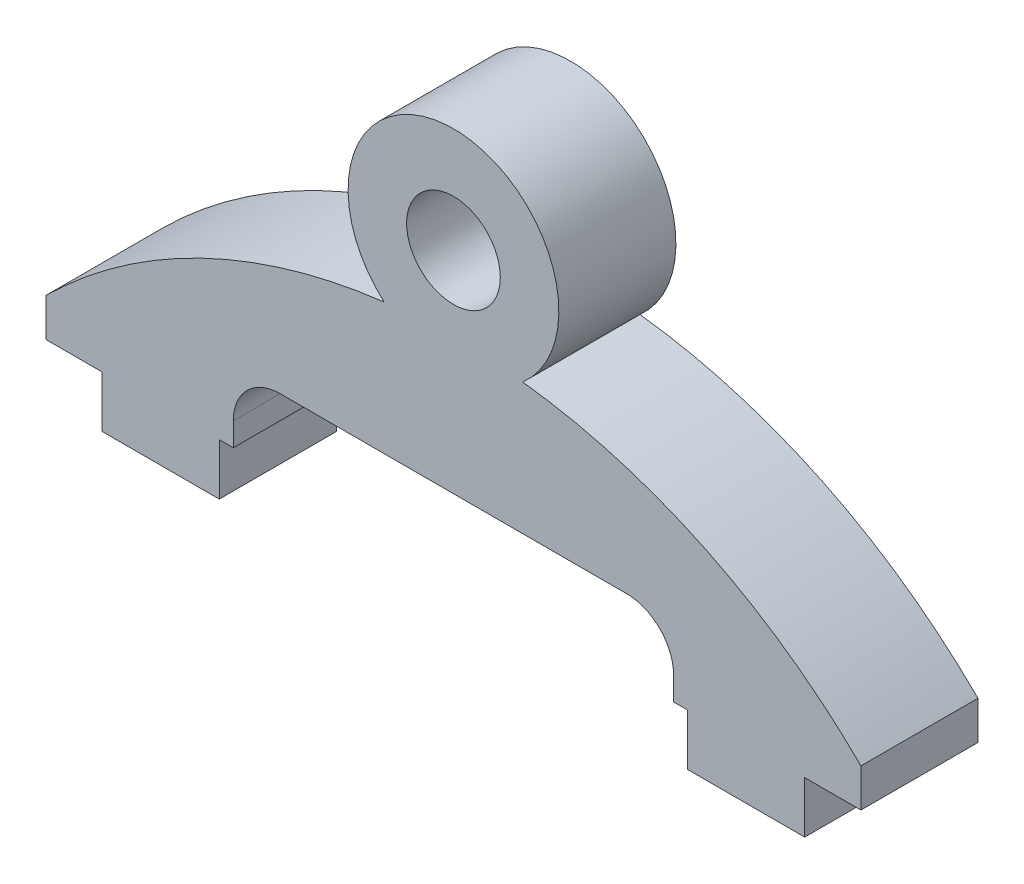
ISO-10303-21;
HEADER;
FILE_DESCRIPTION(('STEP AP214'),'2;1');
FILE_NAME('part.step','',(''),(''),'','','');
FILE_SCHEMA(('AUTOMOTIVE_DESIGN { 1 0 10303 214 1 1 1 1 }'));
ENDSEC;
DATA;
#1=APPLICATION_CONTEXT('core data for automotive mechanical design processes');
#2=APPLICATION_PROTOCOL_DEFINITION('international standard','automotive_design',2000,#1);
#3=PRODUCT_CONTEXT('',#1,'mechanical');
#4=PRODUCT('Part','Part','',(#3));
#5=PRODUCT_RELATED_PRODUCT_CATEGORY('part','',(#4));
#6=PRODUCT_DEFINITION_FORMATION('','',#4);
#7=PRODUCT_DEFINITION_CONTEXT('part definition',#1,'design');
#8=PRODUCT_DEFINITION('design','',#6,#7);
#9=PRODUCT_DEFINITION_SHAPE('','',#8);
#10=(LENGTH_UNIT() NAMED_UNIT(*) SI_UNIT(.MILLI.,.METRE.));
#11=(NAMED_UNIT(*) PLANE_ANGLE_UNIT() SI_UNIT($,.RADIAN.));
#12=(NAMED_UNIT(*) SI_UNIT($,.STERADIAN.) SOLID_ANGLE_UNIT());
#13=UNCERTAINTY_MEASURE_WITH_UNIT(LENGTH_MEASURE(1.E-05),#10,'distance_accuracy_value','');
#14=(GEOMETRIC_REPRESENTATION_CONTEXT(3) GLOBAL_UNCERTAINTY_ASSIGNED_CONTEXT((#13)) GLOBAL_UNIT_ASSIGNED_CONTEXT((#10,
#11,#12)) REPRESENTATION_CONTEXT('',''));
#15=CARTESIAN_POINT('',(0.,0.,0.));
#16=DIRECTION('',(0.,0.,1.));
#17=DIRECTION('',(1.,0.,0.));
#18=AXIS2_PLACEMENT_3D('',#15,#16,#17);
#19=CARTESIAN_POINT('',(9.398,1.27,6.35));
#20=DIRECTION('',(0.,0.,-1.));
#21=DIRECTION('',(-1.,0.,0.));
#22=AXIS2_PLACEMENT_3D('',#19,#20,#21);
#23=CYLINDRICAL_SURFACE('',#22,2.54);
#24=CARTESIAN_POINT('',(9.398,1.27,0.));
#25=DIRECTION('',(0.,0.,1.));
#26=DIRECTION('',(1.,0.,0.));
#27=AXIS2_PLACEMENT_3D('',#24,#25,#26);
#28=CIRCLE('',#27,2.54);
#29=CARTESIAN_POINT('',(11.938,1.26999999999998,0.));
#30=VERTEX_POINT('',#29);
#31=CARTESIAN_POINT('',(9.39799999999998,3.81,0.));
#32=VERTEX_POINT('',#31);
#33=EDGE_CURVE('E205',#30,#32,#28,.T.);
#34=ORIENTED_EDGE('',*,*,#33,.F.);
#35=DIRECTION('',(0.,0.,-1.));
#36=VECTOR('',#35,1.);
#37=CARTESIAN_POINT('',(11.938,1.26999999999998,6.35));
#38=LINE('',#37,#36);
#39=CARTESIAN_POINT('',(11.938,1.26999999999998,6.35));
#40=VERTEX_POINT('',#39);
#41=EDGE_CURVE('E11',#40,#30,#38,.T.);
#42=ORIENTED_EDGE('',*,*,#41,.F.);
#43=CARTESIAN_POINT('',(9.398,1.27,6.35));
#44=DIRECTION('',(0.,0.,1.));
#45=DIRECTION('',(1.,0.,0.));
#46=AXIS2_PLACEMENT_3D('',#43,#44,#45);
#47=CIRCLE('',#46,2.54);
#48=CARTESIAN_POINT('',(9.39799999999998,3.81,6.35));
#49=VERTEX_POINT('',#48);
#50=EDGE_CURVE('E256',#40,#49,#47,.T.);
#51=ORIENTED_EDGE('',*,*,#50,.T.);
#52=DIRECTION('',(0.,0.,-1.));
#53=VECTOR('',#52,1.);
#54=CARTESIAN_POINT('',(9.39799999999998,3.81,6.35));
#55=LINE('',#54,#53);
#56=EDGE_CURVE('E51',#49,#32,#55,.T.);
#57=ORIENTED_EDGE('',*,*,#56,.T.);
#58=EDGE_LOOP('',(#34,#42,#51,#57));
#59=FACE_BOUND('',#58,.T.);
#60=ADVANCED_FACE('F35',(#59),#23,.F.);
#61=CARTESIAN_POINT('',(11.938,0.,6.35));
#62=DIRECTION('',(-1.,0.,0.));
#63=DIRECTION('',(0.,0.,1.));
#64=AXIS2_PLACEMENT_3D('',#61,#62,#63);
#65=PLANE('',#64);
#66=DIRECTION('',(0.,1.,0.));
#67=VECTOR('',#66,1.);
#68=CARTESIAN_POINT('',(11.938,0.,0.));
#69=LINE('',#68,#67);
#70=CARTESIAN_POINT('',(11.938,0.,0.));
#71=VERTEX_POINT('',#70);
#72=EDGE_CURVE('E207',#71,#30,#69,.T.);
#73=ORIENTED_EDGE('',*,*,#72,.F.);
#74=DIRECTION('',(0.,0.,-1.));
#75=VECTOR('',#74,1.);
#76=CARTESIAN_POINT('',(11.938,0.,6.35));
#77=LINE('',#76,#75);
#78=CARTESIAN_POINT('',(11.938,0.,6.35));
#79=VERTEX_POINT('',#78);
#80=EDGE_CURVE('E43',#79,#71,#77,.T.);
#81=ORIENTED_EDGE('',*,*,#80,.F.);
#82=DIRECTION('',(0.,1.,0.));
#83=VECTOR('',#82,1.);
#84=CARTESIAN_POINT('',(11.938,0.,6.35));
#85=LINE('',#84,#83);
#86=EDGE_CURVE('E589',#79,#40,#85,.T.);
#87=ORIENTED_EDGE('',*,*,#86,.T.);
#88=ORIENTED_EDGE('',*,*,#41,.T.);
#89=EDGE_LOOP('',(#73,#81,#87,#88));
#90=FACE_BOUND('',#89,.T.);
#91=ADVANCED_FACE('F301',(#90),#65,.T.);
#92=CARTESIAN_POINT('',(0.,0.,6.35));
#93=DIRECTION('',(0.,-1.,0.));
#94=DIRECTION('',(0.,0.,-1.));
#95=AXIS2_PLACEMENT_3D('',#92,#93,#94);
#96=PLANE('',#95);
#97=DIRECTION('',(-1.,0.,0.));
#98=VECTOR('',#97,1.);
#99=CARTESIAN_POINT('',(0.,0.,0.));
#100=LINE('',#99,#98);
#101=CARTESIAN_POINT('',(12.7,0.,0.));
#102=VERTEX_POINT('',#101);
#103=EDGE_CURVE('E210',#102,#71,#100,.T.);
#104=ORIENTED_EDGE('',*,*,#103,.F.);
#105=DIRECTION('',(0.,0.,-1.));
#106=VECTOR('',#105,1.);
#107=CARTESIAN_POINT('',(12.7,0.,6.35));
#108=LINE('',#107,#106);
#109=CARTESIAN_POINT('',(12.7,0.,6.35));
#110=VERTEX_POINT('',#109);
#111=EDGE_CURVE('E290',#110,#102,#108,.T.);
#112=ORIENTED_EDGE('',*,*,#111,.F.);
#113=DIRECTION('',(-1.,0.,0.));
#114=VECTOR('',#113,1.);
#115=CARTESIAN_POINT('',(0.,0.,6.35));
#116=LINE('',#115,#114);
#117=EDGE_CURVE('E297',#110,#79,#116,.T.);
#118=ORIENTED_EDGE('',*,*,#117,.T.);
#119=ORIENTED_EDGE('',*,*,#80,.T.);
#120=EDGE_LOOP('',(#104,#112,#118,#119));
#121=FACE_BOUND('',#120,.T.);
#122=ADVANCED_FACE('F295',(#121),#96,.T.);
#123=CARTESIAN_POINT('',(12.7,0.,6.35));
#124=DIRECTION('',(1.,0.,0.));
#125=DIRECTION('',(0.,0.,-1.));
#126=AXIS2_PLACEMENT_3D('',#123,#124,#125);
#127=PLANE('',#126);
#128=DIRECTION('',(0.,-1.,0.));
#129=VECTOR('',#128,1.);
#130=CARTESIAN_POINT('',(12.7,0.,0.));
#131=LINE('',#130,#129);
#132=CARTESIAN_POINT('',(12.7,-2.794,0.));
#133=VERTEX_POINT('',#132);
#134=EDGE_CURVE('E213',#102,#133,#131,.T.);
#135=ORIENTED_EDGE('',*,*,#134,.T.);
#136=DIRECTION('',(0.,0.,-1.));
#137=VECTOR('',#136,1.);
#138=CARTESIAN_POINT('',(12.7,-2.794,6.35));
#139=LINE('',#138,#137);
#140=CARTESIAN_POINT('',(12.7,-2.794,6.35));
#141=VERTEX_POINT('',#140);
#142=EDGE_CURVE('E287',#141,#133,#139,.T.);
#143=ORIENTED_EDGE('',*,*,#142,.F.);
#144=DIRECTION('',(0.,-1.,0.));
#145=VECTOR('',#144,1.);
#146=CARTESIAN_POINT('',(12.7,0.,6.35));
#147=LINE('',#146,#145);
#148=EDGE_CURVE('E319',#110,#141,#147,.T.);
#149=ORIENTED_EDGE('',*,*,#148,.F.);
#150=ORIENTED_EDGE('',*,*,#111,.T.);
#151=EDGE_LOOP('',(#135,#143,#149,#150));
#152=FACE_BOUND('',#151,.T.);
#153=ADVANCED_FACE('F309',(#152),#127,.F.);
#154=CARTESIAN_POINT('',(0.,-2.794,6.35));
#155=DIRECTION('',(0.,1.,0.));
#156=DIRECTION('',(-1.,0.,0.));
#157=AXIS2_PLACEMENT_3D('',#154,#155,#156);
#158=PLANE('',#157);
#159=DIRECTION('',(1.,0.,0.));
#160=VECTOR('',#159,1.);
#161=CARTESIAN_POINT('',(0.,-2.794,0.));
#162=LINE('',#161,#160);
#163=CARTESIAN_POINT('',(19.05,-2.794,0.));
#164=VERTEX_POINT('',#163);
#165=EDGE_CURVE('E216',#133,#164,#162,.T.);
#166=ORIENTED_EDGE('',*,*,#165,.T.);
#167=DIRECTION('',(0.,0.,-1.));
#168=VECTOR('',#167,1.);
#169=CARTESIAN_POINT('',(19.05,-2.794,6.35));
#170=LINE('',#169,#168);
#171=CARTESIAN_POINT('',(19.05,-2.794,6.35));
#172=VERTEX_POINT('',#171);
#173=EDGE_CURVE('E285',#172,#164,#170,.T.);
#174=ORIENTED_EDGE('',*,*,#173,.F.);
#175=DIRECTION('',(1.,0.,0.));
#176=VECTOR('',#175,1.);
#177=CARTESIAN_POINT('',(0.,-2.794,6.35));
#178=LINE('',#177,#176);
#179=EDGE_CURVE('E315',#141,#172,#178,.T.);
#180=ORIENTED_EDGE('',*,*,#179,.F.);
#181=ORIENTED_EDGE('',*,*,#142,.T.);
#182=EDGE_LOOP('',(#166,#174,#180,#181));
#183=FACE_BOUND('',#182,.T.);
#184=ADVANCED_FACE('F313',(#183),#158,.F.);
#185=CARTESIAN_POINT('',(19.05,0.,6.35));
#186=DIRECTION('',(1.,0.,0.));
#187=DIRECTION('',(0.,0.,-1.));
#188=AXIS2_PLACEMENT_3D('',#185,#186,#187);
#189=PLANE('',#188);
#190=DIRECTION('',(0.,-1.,0.));
#191=VECTOR('',#190,1.);
#192=CARTESIAN_POINT('',(19.05,0.,0.));
#193=LINE('',#192,#191);
#194=CARTESIAN_POINT('',(19.05,0.,0.));
#195=VERTEX_POINT('',#194);
#196=EDGE_CURVE('E219',#195,#164,#193,.T.);
#197=ORIENTED_EDGE('',*,*,#196,.F.);
#198=DIRECTION('',(0.,0.,-1.));
#199=VECTOR('',#198,1.);
#200=CARTESIAN_POINT('',(19.05,0.,6.35));
#201=LINE('',#200,#199);
#202=CARTESIAN_POINT('',(19.05,0.,6.35));
#203=VERTEX_POINT('',#202);
#204=EDGE_CURVE('E283',#203,#195,#201,.T.);
#205=ORIENTED_EDGE('',*,*,#204,.F.);
#206=DIRECTION('',(0.,-1.,0.));
#207=VECTOR('',#206,1.);
#208=CARTESIAN_POINT('',(19.05,0.,6.35));
#209=LINE('',#208,#207);
#210=EDGE_CURVE('E318',#203,#172,#209,.T.);
#211=ORIENTED_EDGE('',*,*,#210,.T.);
#212=ORIENTED_EDGE('',*,*,#173,.T.);
#213=EDGE_LOOP('',(#197,#205,#211,#212));
#214=FACE_BOUND('',#213,.T.);
#215=ADVANCED_FACE('F533',(#214),#189,.T.);
#216=CARTESIAN_POINT('',(22.098,0.,0.));
#217=VERTEX_POINT('',#216);
#218=EDGE_CURVE('E214',#217,#195,#100,.T.);
#219=ORIENTED_EDGE('',*,*,#218,.F.);
#220=DIRECTION('',(0.,0.,-1.));
#221=VECTOR('',#220,1.);
#222=CARTESIAN_POINT('',(22.098,0.,6.35));
#223=LINE('',#222,#221);
#224=CARTESIAN_POINT('',(22.098,0.,6.35));
#225=VERTEX_POINT('',#224);
#226=EDGE_CURVE('E281',#225,#217,#223,.T.);
#227=ORIENTED_EDGE('',*,*,#226,.F.);
#228=EDGE_CURVE('E321',#225,#203,#116,.T.);
#229=ORIENTED_EDGE('',*,*,#228,.T.);
#230=ORIENTED_EDGE('',*,*,#204,.T.);
#231=EDGE_LOOP('',(#219,#227,#229,#230));
#232=FACE_BOUND('',#231,.T.);
#233=ADVANCED_FACE('F523',(#232),#96,.T.);
#234=CARTESIAN_POINT('',(22.098,0.,6.35));
#235=DIRECTION('',(-1.,0.,0.));
#236=DIRECTION('',(0.,0.,1.));
#237=AXIS2_PLACEMENT_3D('',#234,#235,#236);
#238=PLANE('',#237);
#239=DIRECTION('',(0.,1.,0.));
#240=VECTOR('',#239,1.);
#241=CARTESIAN_POINT('',(22.098,0.,0.));
#242=LINE('',#241,#240);
#243=CARTESIAN_POINT('',(22.098,2.07663375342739,0.));
#244=VERTEX_POINT('',#243);
#245=EDGE_CURVE('E222',#217,#244,#242,.T.);
#246=ORIENTED_EDGE('',*,*,#245,.T.);
#247=DIRECTION('',(0.,0.,-1.));
#248=VECTOR('',#247,1.);
#249=CARTESIAN_POINT('',(22.098,2.07663375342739,6.35));
#250=LINE('',#249,#248);
#251=CARTESIAN_POINT('',(22.098,2.07663375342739,6.35));
#252=VERTEX_POINT('',#251);
#253=EDGE_CURVE('E278',#252,#244,#250,.T.);
#254=ORIENTED_EDGE('',*,*,#253,.F.);
#255=DIRECTION('',(0.,1.,0.));
#256=VECTOR('',#255,1.);
#257=CARTESIAN_POINT('',(22.098,0.,6.35));
#258=LINE('',#257,#256);
#259=EDGE_CURVE('E326',#225,#252,#258,.T.);
#260=ORIENTED_EDGE('',*,*,#259,.F.);
#261=ORIENTED_EDGE('',*,*,#226,.T.);
#262=EDGE_LOOP('',(#246,#254,#260,#261));
#263=FACE_BOUND('',#262,.T.);
#264=ADVANCED_FACE('F513',(#263),#238,.F.);
#265=CARTESIAN_POINT('',(0.067141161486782,-20.122779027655,6.35));
#266=DIRECTION('',(0.,0.,-1.));
#267=DIRECTION('',(-1.,0.,0.));
#268=AXIS2_PLACEMENT_3D('',#265,#266,#267);
#269=CYLINDRICAL_SURFACE('',#268,31.2757520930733);
#270=CARTESIAN_POINT('',(0.067141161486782,-20.122779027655,0.));
#271=DIRECTION('',(0.,0.,1.));
#272=DIRECTION('',(1.,0.,0.));
#273=AXIS2_PLACEMENT_3D('',#270,#271,#272);
#274=CIRCLE('',#273,31.2757520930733);
#275=CARTESIAN_POINT('',(3.75808520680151,10.9344198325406,0.));
#276=VERTEX_POINT('',#275);
#277=EDGE_CURVE('E224',#244,#276,#274,.T.);
#278=ORIENTED_EDGE('',*,*,#277,.T.);
#279=DIRECTION('',(0.,0.,-1.));
#280=VECTOR('',#279,1.);
#281=CARTESIAN_POINT('',(3.75808520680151,10.9344198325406,6.35));
#282=LINE('',#281,#280);
#283=CARTESIAN_POINT('',(3.75808520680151,10.9344198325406,6.35));
#284=VERTEX_POINT('',#283);
#285=EDGE_CURVE('E275',#284,#276,#282,.T.);
#286=ORIENTED_EDGE('',*,*,#285,.F.);
#287=CARTESIAN_POINT('',(0.067141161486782,-20.122779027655,6.35));
#288=DIRECTION('',(0.,0.,1.));
#289=DIRECTION('',(1.,0.,0.));
#290=AXIS2_PLACEMENT_3D('',#287,#288,#289);
#291=CIRCLE('',#290,31.2757520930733);
#292=EDGE_CURVE('E328',#252,#284,#291,.T.);
#293=ORIENTED_EDGE('',*,*,#292,.F.);
#294=ORIENTED_EDGE('',*,*,#253,.T.);
#295=EDGE_LOOP('',(#278,#286,#293,#294));
#296=FACE_BOUND('',#295,.T.);
#297=ADVANCED_FACE('F503',(#296),#269,.T.);
#298=CARTESIAN_POINT('',(0.,15.24,6.35));
#299=DIRECTION('',(0.,0.,-1.));
#300=DIRECTION('',(-1.,0.,0.));
#301=AXIS2_PLACEMENT_3D('',#298,#299,#300);
#302=CYLINDRICAL_SURFACE('',#301,5.715);
#303=CARTESIAN_POINT('',(0.,15.24,0.));
#304=DIRECTION('',(0.,0.,1.));
#305=DIRECTION('',(1.,0.,0.));
#306=AXIS2_PLACEMENT_3D('',#303,#304,#305);
#307=CIRCLE('',#306,5.715);
#308=CARTESIAN_POINT('',(-3.75808520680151,10.9344198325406,0.));
#309=VERTEX_POINT('',#308);
#310=EDGE_CURVE('E226',#276,#309,#307,.T.);
#311=ORIENTED_EDGE('',*,*,#310,.T.);
#312=DIRECTION('',(0.,0.,-1.));
#313=VECTOR('',#312,1.);
#314=CARTESIAN_POINT('',(-3.75808520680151,10.9344198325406,6.35));
#315=LINE('',#314,#313);
#316=CARTESIAN_POINT('',(-3.75808520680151,10.9344198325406,6.35));
#317=VERTEX_POINT('',#316);
#318=EDGE_CURVE('E273',#317,#309,#315,.T.);
#319=ORIENTED_EDGE('',*,*,#318,.F.);
#320=CARTESIAN_POINT('',(0.,15.24,6.35));
#321=DIRECTION('',(0.,0.,1.));
#322=DIRECTION('',(1.,0.,0.));
#323=AXIS2_PLACEMENT_3D('',#320,#321,#322);
#324=CIRCLE('',#323,5.715);
#325=EDGE_CURVE('E330',#284,#317,#324,.T.);
#326=ORIENTED_EDGE('',*,*,#325,.F.);
#327=ORIENTED_EDGE('',*,*,#285,.T.);
#328=EDGE_LOOP('',(#311,#319,#326,#327));
#329=FACE_BOUND('',#328,.T.);
#330=ADVANCED_FACE('F493',(#329),#302,.T.);
#331=CARTESIAN_POINT('',(-0.067141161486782,-20.122779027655,6.35));
#332=DIRECTION('',(0.,0.,-1.));
#333=DIRECTION('',(-1.,0.,0.));
#334=AXIS2_PLACEMENT_3D('',#331,#332,#333);
#335=CYLINDRICAL_SURFACE('',#334,31.2757520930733);
#336=CARTESIAN_POINT('',(-0.067141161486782,-20.122779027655,0.));
#337=DIRECTION('',(0.,0.,1.));
#338=DIRECTION('',(1.,0.,0.));
#339=AXIS2_PLACEMENT_3D('',#336,#337,#338);
#340=CIRCLE('',#339,31.2757520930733);
#341=CARTESIAN_POINT('',(-22.098,2.07663375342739,0.));
#342=VERTEX_POINT('',#341);
#343=EDGE_CURVE('E229',#342,#309,#340,.F.);
#344=ORIENTED_EDGE('',*,*,#343,.F.);
#345=DIRECTION('',(0.,0.,-1.));
#346=VECTOR('',#345,1.);
#347=CARTESIAN_POINT('',(-22.098,2.07663375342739,6.35));
#348=LINE('',#347,#346);
#349=CARTESIAN_POINT('',(-22.098,2.07663375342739,6.35));
#350=VERTEX_POINT('',#349);
#351=EDGE_CURVE('E271',#350,#342,#348,.T.);
#352=ORIENTED_EDGE('',*,*,#351,.F.);
#353=CARTESIAN_POINT('',(-0.067141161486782,-20.122779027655,6.35));
#354=DIRECTION('',(0.,0.,1.));
#355=DIRECTION('',(1.,0.,0.));
#356=AXIS2_PLACEMENT_3D('',#353,#354,#355);
#357=CIRCLE('',#356,31.2757520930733);
#358=EDGE_CURVE('E332',#350,#317,#357,.F.);
#359=ORIENTED_EDGE('',*,*,#358,.T.);
#360=ORIENTED_EDGE('',*,*,#318,.T.);
#361=EDGE_LOOP('',(#344,#352,#359,#360));
#362=FACE_BOUND('',#361,.T.);
#363=ADVANCED_FACE('F483',(#362),#335,.T.);
#364=CARTESIAN_POINT('',(-22.098,0.,6.35));
#365=DIRECTION('',(-1.,0.,0.));
#366=DIRECTION('',(0.,0.,1.));
#367=AXIS2_PLACEMENT_3D('',#364,#365,#366);
#368=PLANE('',#367);
#369=DIRECTION('',(0.,1.,0.));
#370=VECTOR('',#369,1.);
#371=CARTESIAN_POINT('',(-22.098,0.,0.));
#372=LINE('',#371,#370);
#373=CARTESIAN_POINT('',(-22.098,0.,0.));
#374=VERTEX_POINT('',#373);
#375=EDGE_CURVE('E232',#374,#342,#372,.T.);
#376=ORIENTED_EDGE('',*,*,#375,.F.);
#377=DIRECTION('',(0.,0.,-1.));
#378=VECTOR('',#377,1.);
#379=CARTESIAN_POINT('',(-22.098,0.,6.35));
#380=LINE('',#379,#378);
#381=CARTESIAN_POINT('',(-22.098,0.,6.35));
#382=VERTEX_POINT('',#381);
#383=EDGE_CURVE('E269',#382,#374,#380,.T.);
#384=ORIENTED_EDGE('',*,*,#383,.F.);
#385=DIRECTION('',(0.,1.,0.));
#386=VECTOR('',#385,1.);
#387=CARTESIAN_POINT('',(-22.098,0.,6.35));
#388=LINE('',#387,#386);
#389=EDGE_CURVE('E335',#382,#350,#388,.T.);
#390=ORIENTED_EDGE('',*,*,#389,.T.);
#391=ORIENTED_EDGE('',*,*,#351,.T.);
#392=EDGE_LOOP('',(#376,#384,#390,#391));
#393=FACE_BOUND('',#392,.T.);
#394=ADVANCED_FACE('F370',(#393),#368,.T.);
#395=CARTESIAN_POINT('',(0.,0.,6.35));
#396=DIRECTION('',(0.,1.,0.));
#397=DIRECTION('',(0.,0.,1.));
#398=AXIS2_PLACEMENT_3D('',#395,#396,#397);
#399=PLANE('',#398);
#400=DIRECTION('',(1.,0.,0.));
#401=VECTOR('',#400,1.);
#402=CARTESIAN_POINT('',(0.,0.,0.));
#403=LINE('',#402,#401);
#404=CARTESIAN_POINT('',(-19.05,0.,0.));
#405=VERTEX_POINT('',#404);
#406=EDGE_CURVE('E235',#374,#405,#403,.T.);
#407=ORIENTED_EDGE('',*,*,#406,.T.);
#408=DIRECTION('',(0.,0.,-1.));
#409=VECTOR('',#408,1.);
#410=CARTESIAN_POINT('',(-19.05,0.,6.35));
#411=LINE('',#410,#409);
#412=CARTESIAN_POINT('',(-19.05,0.,6.35));
#413=VERTEX_POINT('',#412);
#414=EDGE_CURVE('E266',#413,#405,#411,.T.);
#415=ORIENTED_EDGE('',*,*,#414,.F.);
#416=DIRECTION('',(1.,0.,0.));
#417=VECTOR('',#416,1.);
#418=CARTESIAN_POINT('',(0.,0.,6.35));
#419=LINE('',#418,#417);
#420=EDGE_CURVE('E338',#382,#413,#419,.T.);
#421=ORIENTED_EDGE('',*,*,#420,.F.);
#422=ORIENTED_EDGE('',*,*,#383,.T.);
#423=EDGE_LOOP('',(#407,#415,#421,#422));
#424=FACE_BOUND('',#423,.T.);
#425=ADVANCED_FACE('F361',(#424),#399,.F.);
#426=CARTESIAN_POINT('',(-19.05,0.,6.35));
#427=DIRECTION('',(1.,0.,0.));
#428=DIRECTION('',(0.,0.,-1.));
#429=AXIS2_PLACEMENT_3D('',#426,#427,#428);
#430=PLANE('',#429);
#431=DIRECTION('',(0.,-1.,0.));
#432=VECTOR('',#431,1.);
#433=CARTESIAN_POINT('',(-19.05,0.,0.));
#434=LINE('',#433,#432);
#435=CARTESIAN_POINT('',(-19.05,-2.794,0.));
#436=VERTEX_POINT('',#435);
#437=EDGE_CURVE('E237',#405,#436,#434,.T.);
#438=ORIENTED_EDGE('',*,*,#437,.T.);
#439=DIRECTION('',(0.,0.,-1.));
#440=VECTOR('',#439,1.);
#441=CARTESIAN_POINT('',(-19.05,-2.794,6.35));
#442=LINE('',#441,#440);
#443=CARTESIAN_POINT('',(-19.05,-2.794,6.35));
#444=VERTEX_POINT('',#443);
#445=EDGE_CURVE('E264',#444,#436,#442,.T.);
#446=ORIENTED_EDGE('',*,*,#445,.F.);
#447=DIRECTION('',(0.,-1.,0.));
#448=VECTOR('',#447,1.);
#449=CARTESIAN_POINT('',(-19.05,0.,6.35));
#450=LINE('',#449,#448);
#451=EDGE_CURVE('E340',#413,#444,#450,.T.);
#452=ORIENTED_EDGE('',*,*,#451,.F.);
#453=ORIENTED_EDGE('',*,*,#414,.T.);
#454=EDGE_LOOP('',(#438,#446,#452,#453));
#455=FACE_BOUND('',#454,.T.);
#456=ADVANCED_FACE('F369',(#455),#430,.F.);
#457=CARTESIAN_POINT('',(0.,-2.794,6.35));
#458=DIRECTION('',(0.,-1.,0.));
#459=DIRECTION('',(1.,0.,0.));
#460=AXIS2_PLACEMENT_3D('',#457,#458,#459);
#461=PLANE('',#460);
#462=DIRECTION('',(-1.,0.,0.));
#463=VECTOR('',#462,1.);
#464=CARTESIAN_POINT('',(0.,-2.794,0.));
#465=LINE('',#464,#463);
#466=CARTESIAN_POINT('',(-12.7,-2.794,0.));
#467=VERTEX_POINT('',#466);
#468=EDGE_CURVE('E241',#467,#436,#465,.T.);
#469=ORIENTED_EDGE('',*,*,#468,.F.);
#470=DIRECTION('',(0.,0.,-1.));
#471=VECTOR('',#470,1.);
#472=CARTESIAN_POINT('',(-12.7,-2.794,6.35));
#473=LINE('',#472,#471);
#474=CARTESIAN_POINT('',(-12.7,-2.794,6.35));
#475=VERTEX_POINT('',#474);
#476=EDGE_CURVE('E262',#475,#467,#473,.T.);
#477=ORIENTED_EDGE('',*,*,#476,.F.);
#478=DIRECTION('',(-1.,0.,0.));
#479=VECTOR('',#478,1.);
#480=CARTESIAN_POINT('',(0.,-2.794,6.35));
#481=LINE('',#480,#479);
#482=EDGE_CURVE('E342',#475,#444,#481,.T.);
#483=ORIENTED_EDGE('',*,*,#482,.T.);
#484=ORIENTED_EDGE('',*,*,#445,.T.);
#485=EDGE_LOOP('',(#469,#477,#483,#484));
#486=FACE_BOUND('',#485,.T.);
#487=ADVANCED_FACE('F354',(#486),#461,.T.);
#488=CARTESIAN_POINT('',(-12.7,0.,6.35));
#489=DIRECTION('',(1.,0.,0.));
#490=DIRECTION('',(0.,0.,-1.));
#491=AXIS2_PLACEMENT_3D('',#488,#489,#490);
#492=PLANE('',#491);
#493=DIRECTION('',(0.,-1.,0.));
#494=VECTOR('',#493,1.);
#495=CARTESIAN_POINT('',(-12.7,0.,0.));
#496=LINE('',#495,#494);
#497=CARTESIAN_POINT('',(-12.7,0.,0.));
#498=VERTEX_POINT('',#497);
#499=EDGE_CURVE('E244',#498,#467,#496,.T.);
#500=ORIENTED_EDGE('',*,*,#499,.F.);
#501=DIRECTION('',(0.,0.,-1.));
#502=VECTOR('',#501,1.);
#503=CARTESIAN_POINT('',(-12.7,0.,6.35));
#504=LINE('',#503,#502);
#505=CARTESIAN_POINT('',(-12.7,0.,6.35));
#506=VERTEX_POINT('',#505);
#507=EDGE_CURVE('E260',#506,#498,#504,.T.);
#508=ORIENTED_EDGE('',*,*,#507,.F.);
#509=DIRECTION('',(0.,-1.,0.));
#510=VECTOR('',#509,1.);
#511=CARTESIAN_POINT('',(-12.7,0.,6.35));
#512=LINE('',#511,#510);
#513=EDGE_CURVE('E344',#506,#475,#512,.T.);
#514=ORIENTED_EDGE('',*,*,#513,.T.);
#515=ORIENTED_EDGE('',*,*,#476,.T.);
#516=EDGE_LOOP('',(#500,#508,#514,#515));
#517=FACE_BOUND('',#516,.T.);
#518=ADVANCED_FACE('F348',(#517),#492,.T.);
#519=CARTESIAN_POINT('',(-11.938,0.,0.));
#520=VERTEX_POINT('',#519);
#521=EDGE_CURVE('E238',#498,#520,#403,.T.);
#522=ORIENTED_EDGE('',*,*,#521,.T.);
#523=DIRECTION('',(0.,0.,-1.));
#524=VECTOR('',#523,1.);
#525=CARTESIAN_POINT('',(-11.938,0.,6.35));
#526=LINE('',#525,#524);
#527=CARTESIAN_POINT('',(-11.938,0.,6.35));
#528=VERTEX_POINT('',#527);
#529=EDGE_CURVE('E194',#528,#520,#526,.T.);
#530=ORIENTED_EDGE('',*,*,#529,.F.);
#531=EDGE_CURVE('E182',#506,#528,#419,.T.);
#532=ORIENTED_EDGE('',*,*,#531,.F.);
#533=ORIENTED_EDGE('',*,*,#507,.T.);
#534=EDGE_LOOP('',(#522,#530,#532,#533));
#535=FACE_BOUND('',#534,.T.);
#536=ADVANCED_FACE('F358',(#535),#399,.F.);
#537=CARTESIAN_POINT('',(-11.938,0.,6.35));
#538=DIRECTION('',(-1.,0.,0.));
#539=DIRECTION('',(0.,0.,1.));
#540=AXIS2_PLACEMENT_3D('',#537,#538,#539);
#541=PLANE('',#540);
#542=DIRECTION('',(0.,1.,0.));
#543=VECTOR('',#542,1.);
#544=CARTESIAN_POINT('',(-11.938,0.,0.));
#545=LINE('',#544,#543);
#546=CARTESIAN_POINT('',(-11.938,1.26999999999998,0.));
#547=VERTEX_POINT('',#546);
#548=EDGE_CURVE('E191',#520,#547,#545,.T.);
#549=ORIENTED_EDGE('',*,*,#548,.T.);
#550=DIRECTION('',(0.,0.,-1.));
#551=VECTOR('',#550,1.);
#552=CARTESIAN_POINT('',(-11.938,1.26999999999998,6.35));
#553=LINE('',#552,#551);
#554=CARTESIAN_POINT('',(-11.938,1.26999999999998,6.35));
#555=VERTEX_POINT('',#554);
#556=EDGE_CURVE('E188',#555,#547,#553,.T.);
#557=ORIENTED_EDGE('',*,*,#556,.F.);
#558=DIRECTION('',(0.,1.,0.));
#559=VECTOR('',#558,1.);
#560=CARTESIAN_POINT('',(-11.938,0.,6.35));
#561=LINE('',#560,#559);
#562=EDGE_CURVE('E173',#528,#555,#561,.T.);
#563=ORIENTED_EDGE('',*,*,#562,.F.);
#564=ORIENTED_EDGE('',*,*,#529,.T.);
#565=EDGE_LOOP('',(#549,#557,#563,#564));
#566=FACE_BOUND('',#565,.T.);
#567=ADVANCED_FACE('F189',(#566),#541,.F.);
#568=CARTESIAN_POINT('',(-9.398,1.27,6.35));
#569=DIRECTION('',(0.,0.,-1.));
#570=DIRECTION('',(-1.,0.,0.));
#571=AXIS2_PLACEMENT_3D('',#568,#569,#570);
#572=CYLINDRICAL_SURFACE('',#571,2.54);
#573=CARTESIAN_POINT('',(-9.398,1.27,0.));
#574=DIRECTION('',(0.,0.,1.));
#575=DIRECTION('',(1.,0.,0.));
#576=AXIS2_PLACEMENT_3D('',#573,#574,#575);
#577=CIRCLE('',#576,2.54);
#578=CARTESIAN_POINT('',(-9.39799999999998,3.81,0.));
#579=VERTEX_POINT('',#578);
#580=EDGE_CURVE('E248',#547,#579,#577,.F.);
#581=ORIENTED_EDGE('',*,*,#580,.T.);
#582=DIRECTION('',(0.,0.,-1.));
#583=VECTOR('',#582,1.);
#584=CARTESIAN_POINT('',(-9.39799999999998,3.81,6.35));
#585=LINE('',#584,#583);
#586=CARTESIAN_POINT('',(-9.39799999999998,3.81,6.35));
#587=VERTEX_POINT('',#586);
#588=EDGE_CURVE('E113',#587,#579,#585,.T.);
#589=ORIENTED_EDGE('',*,*,#588,.F.);
#590=CARTESIAN_POINT('',(-9.398,1.27,6.35));
#591=DIRECTION('',(0.,0.,1.));
#592=DIRECTION('',(1.,0.,0.));
#593=AXIS2_PLACEMENT_3D('',#590,#591,#592);
#594=CIRCLE('',#593,2.54);
#595=EDGE_CURVE('E179',#555,#587,#594,.F.);
#596=ORIENTED_EDGE('',*,*,#595,.F.);
#597=ORIENTED_EDGE('',*,*,#556,.T.);
#598=EDGE_LOOP('',(#581,#589,#596,#597));
#599=FACE_BOUND('',#598,.T.);
#600=ADVANCED_FACE('F196',(#599),#572,.F.);
#601=CARTESIAN_POINT('',(0.,3.81,6.35));
#602=DIRECTION('',(0.,-1.,0.));
#603=DIRECTION('',(0.,0.,-1.));
#604=AXIS2_PLACEMENT_3D('',#601,#602,#603);
#605=PLANE('',#604);
#606=DIRECTION('',(-1.,0.,0.));
#607=VECTOR('',#606,1.);
#608=CARTESIAN_POINT('',(0.,3.81,0.));
#609=LINE('',#608,#607);
#610=EDGE_CURVE('E250',#32,#579,#609,.T.);
#611=ORIENTED_EDGE('',*,*,#610,.F.);
#612=ORIENTED_EDGE('',*,*,#56,.F.);
#613=DIRECTION('',(-1.,0.,0.));
#614=VECTOR('',#613,1.);
#615=CARTESIAN_POINT('',(0.,3.81,6.35));
#616=LINE('',#615,#614);
#617=EDGE_CURVE('E197',#49,#587,#616,.T.);
#618=ORIENTED_EDGE('',*,*,#617,.T.);
#619=ORIENTED_EDGE('',*,*,#588,.T.);
#620=EDGE_LOOP('',(#611,#612,#618,#619));
#621=FACE_BOUND('',#620,.T.);
#622=ADVANCED_FACE('F376',(#621),#605,.T.);
#623=CARTESIAN_POINT('',(0.,15.24,6.35));
#624=DIRECTION('',(0.,0.,-1.));
#625=DIRECTION('',(-1.,0.,0.));
#626=AXIS2_PLACEMENT_3D('',#623,#624,#625);
#627=CYLINDRICAL_SURFACE('',#626,2.54);
#628=CARTESIAN_POINT('',(0.,15.24,6.35));
#629=DIRECTION('',(0.,0.,1.));
#630=DIRECTION('',(1.,0.,0.));
#631=AXIS2_PLACEMENT_3D('',#628,#629,#630);
#632=CIRCLE('',#631,2.54);
#633=CARTESIAN_POINT('',(2.54,15.24,6.35));
#634=VERTEX_POINT('',#633);
#635=EDGE_CURVE('E199',#634,#634,#632,.T.);
#636=ORIENTED_EDGE('',*,*,#635,.T.);
#637=EDGE_LOOP('',(#636));
#638=FACE_BOUND('',#637,.T.);
#639=CARTESIAN_POINT('',(0.,15.24,0.));
#640=DIRECTION('',(0.,0.,1.));
#641=DIRECTION('',(1.,0.,0.));
#642=AXIS2_PLACEMENT_3D('',#639,#640,#641);
#643=CIRCLE('',#642,2.54);
#644=CARTESIAN_POINT('',(2.54,15.24,0.));
#645=VERTEX_POINT('',#644);
#646=EDGE_CURVE('E253',#645,#645,#643,.T.);
#647=ORIENTED_EDGE('',*,*,#646,.F.);
#648=EDGE_LOOP('',(#647));
#649=FACE_BOUND('',#648,.T.);
#650=ADVANCED_FACE('F378',(#638,#649),#627,.F.);
#651=CARTESIAN_POINT('',(0.,0.,6.35));
#652=DIRECTION('',(0.,0.,1.));
#653=DIRECTION('',(1.,0.,0.));
#654=AXIS2_PLACEMENT_3D('',#651,#652,#653);
#655=PLANE('',#654);
#656=ORIENTED_EDGE('',*,*,#50,.F.);
#657=ORIENTED_EDGE('',*,*,#86,.F.);
#658=ORIENTED_EDGE('',*,*,#117,.F.);
#659=ORIENTED_EDGE('',*,*,#148,.T.);
#660=ORIENTED_EDGE('',*,*,#179,.T.);
#661=ORIENTED_EDGE('',*,*,#210,.F.);
#662=ORIENTED_EDGE('',*,*,#228,.F.);
#663=ORIENTED_EDGE('',*,*,#259,.T.);
#664=ORIENTED_EDGE('',*,*,#292,.T.);
#665=ORIENTED_EDGE('',*,*,#325,.T.);
#666=ORIENTED_EDGE('',*,*,#358,.F.);
#667=ORIENTED_EDGE('',*,*,#389,.F.);
#668=ORIENTED_EDGE('',*,*,#420,.T.);
#669=ORIENTED_EDGE('',*,*,#451,.T.);
#670=ORIENTED_EDGE('',*,*,#482,.F.);
#671=ORIENTED_EDGE('',*,*,#513,.F.);
#672=ORIENTED_EDGE('',*,*,#531,.T.);
#673=ORIENTED_EDGE('',*,*,#562,.T.);
#674=ORIENTED_EDGE('',*,*,#595,.T.);
#675=ORIENTED_EDGE('',*,*,#617,.F.);
#676=EDGE_LOOP('',(#656,#657,#658,#659,#660,#661,#662,#663,#664,#665,#666,#667,#668,#669,#670,
#671,#672,#673,#674,#675));
#677=FACE_BOUND('',#676,.T.);
#678=ORIENTED_EDGE('',*,*,#635,.F.);
#679=EDGE_LOOP('',(#678));
#680=FACE_BOUND('',#679,.T.);
#681=ADVANCED_FACE('F175',(#677,#680),#655,.T.);
#682=CARTESIAN_POINT('',(0.,0.,0.));
#683=DIRECTION('',(0.,0.,1.));
#684=DIRECTION('',(1.,0.,0.));
#685=AXIS2_PLACEMENT_3D('',#682,#683,#684);
#686=PLANE('',#685);
#687=ORIENTED_EDGE('',*,*,#33,.T.);
#688=ORIENTED_EDGE('',*,*,#610,.T.);
#689=ORIENTED_EDGE('',*,*,#580,.F.);
#690=ORIENTED_EDGE('',*,*,#548,.F.);
#691=ORIENTED_EDGE('',*,*,#521,.F.);
#692=ORIENTED_EDGE('',*,*,#499,.T.);
#693=ORIENTED_EDGE('',*,*,#468,.T.);
#694=ORIENTED_EDGE('',*,*,#437,.F.);
#695=ORIENTED_EDGE('',*,*,#406,.F.);
#696=ORIENTED_EDGE('',*,*,#375,.T.);
#697=ORIENTED_EDGE('',*,*,#343,.T.);
#698=ORIENTED_EDGE('',*,*,#310,.F.);
#699=ORIENTED_EDGE('',*,*,#277,.F.);
#700=ORIENTED_EDGE('',*,*,#245,.F.);
#701=ORIENTED_EDGE('',*,*,#218,.T.);
#702=ORIENTED_EDGE('',*,*,#196,.T.);
#703=ORIENTED_EDGE('',*,*,#165,.F.);
#704=ORIENTED_EDGE('',*,*,#134,.F.);
#705=ORIENTED_EDGE('',*,*,#103,.T.);
#706=ORIENTED_EDGE('',*,*,#72,.T.);
#707=EDGE_LOOP('',(#687,#688,#689,#690,#691,#692,#693,#694,#695,#696,#697,#698,#699,#700,#701,
#702,#703,#704,#705,#706));
#708=FACE_BOUND('',#707,.T.);
#709=ORIENTED_EDGE('',*,*,#646,.T.);
#710=EDGE_LOOP('',(#709));
#711=FACE_BOUND('',#710,.T.);
#712=ADVANCED_FACE('F304',(#708,#711),#686,.F.);
#713=CLOSED_SHELL('',(#60,#91,#122,#153,#184,#215,#233,#264,#297,#330,#363,#394,#425,#456,#487,
#518,#536,#567,#600,#622,#650,#681,#712));
#714=MANIFOLD_SOLID_BREP('B2',#713);
#715=ADVANCED_BREP_SHAPE_REPRESENTATION('',(#18,#714),#14);
#716=SHAPE_DEFINITION_REPRESENTATION(#9,#715);
ENDSEC;
END-ISO-10303-21;
